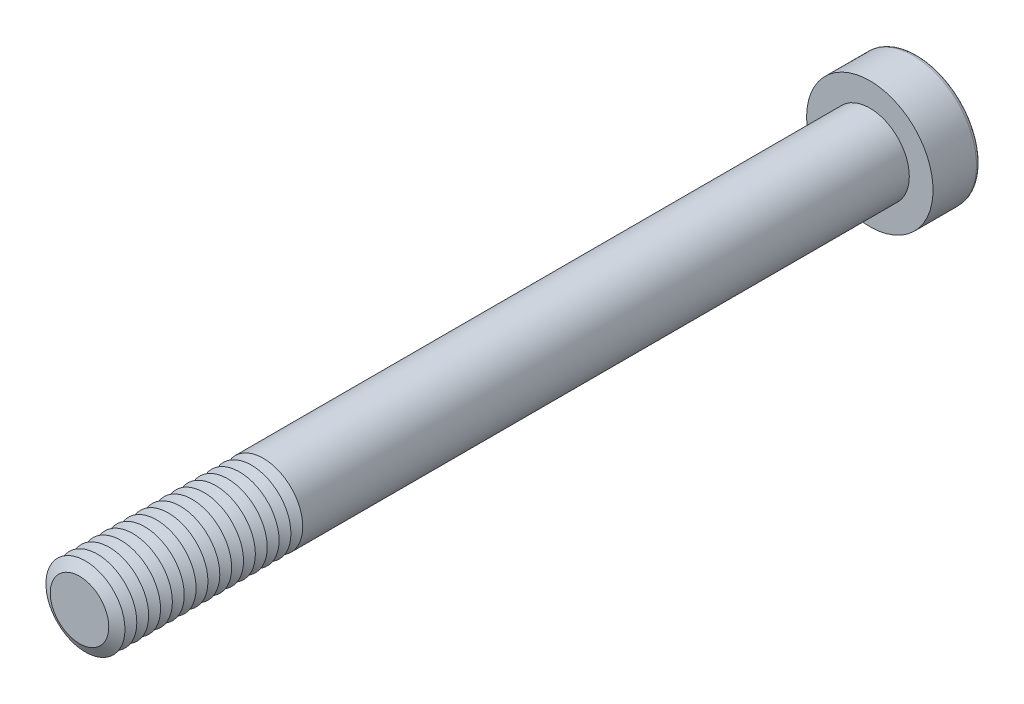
ISO-10303-21;
HEADER;
FILE_DESCRIPTION(('STEP AP214'),'2;1');
FILE_NAME('part.step','',(''),(''),'','','');
FILE_SCHEMA(('AUTOMOTIVE_DESIGN { 1 0 10303 214 1 1 1 1 }'));
ENDSEC;
DATA;
#1=APPLICATION_CONTEXT('core data for automotive mechanical design processes');
#2=APPLICATION_PROTOCOL_DEFINITION('international standard','automotive_design',2000,#1);
#3=PRODUCT_CONTEXT('',#1,'mechanical');
#4=PRODUCT('Part','Part','',(#3));
#5=PRODUCT_RELATED_PRODUCT_CATEGORY('part','',(#4));
#6=PRODUCT_DEFINITION_FORMATION('','',#4);
#7=PRODUCT_DEFINITION_CONTEXT('part definition',#1,'design');
#8=PRODUCT_DEFINITION('design','',#6,#7);
#9=PRODUCT_DEFINITION_SHAPE('','',#8);
#10=(LENGTH_UNIT() NAMED_UNIT(*) SI_UNIT(.MILLI.,.METRE.));
#11=(NAMED_UNIT(*) PLANE_ANGLE_UNIT() SI_UNIT($,.RADIAN.));
#12=(NAMED_UNIT(*) SI_UNIT($,.STERADIAN.) SOLID_ANGLE_UNIT());
#13=UNCERTAINTY_MEASURE_WITH_UNIT(LENGTH_MEASURE(1.E-05),#10,'distance_accuracy_value','');
#14=(GEOMETRIC_REPRESENTATION_CONTEXT(3) GLOBAL_UNCERTAINTY_ASSIGNED_CONTEXT((#13)) GLOBAL_UNIT_ASSIGNED_CONTEXT((#10,
#11,#12)) REPRESENTATION_CONTEXT('',''));
#15=CARTESIAN_POINT('',(0.,0.,0.));
#16=DIRECTION('',(0.,0.,1.));
#17=DIRECTION('',(1.,0.,0.));
#18=AXIS2_PLACEMENT_3D('',#15,#16,#17);
#19=CARTESIAN_POINT('',(0.,0.,94.75));
#20=DIRECTION('',(0.,0.,1.));
#21=DIRECTION('',(1.,0.,0.));
#22=AXIS2_PLACEMENT_3D('',#19,#20,#21);
#23=CONICAL_SURFACE('',#22,5.,1.0471975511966);
#24=CARTESIAN_POINT('',(0.,0.,94.));
#25=DIRECTION('',(0.,0.,1.));
#26=DIRECTION('',(1.,0.,0.));
#27=AXIS2_PLACEMENT_3D('',#24,#25,#26);
#28=CIRCLE('',#27,3.70096189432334);
#29=CARTESIAN_POINT('',(3.70096189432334,0.,94.));
#30=VERTEX_POINT('',#29);
#31=EDGE_CURVE('E313',#30,#30,#28,.T.);
#32=ORIENTED_EDGE('',*,*,#31,.T.);
#33=EDGE_LOOP('',(#32));
#34=FACE_BOUND('',#33,.T.);
#35=CARTESIAN_POINT('',(0.,0.,94.75));
#36=DIRECTION('',(0.,0.,1.));
#37=DIRECTION('',(1.,0.,0.));
#38=AXIS2_PLACEMENT_3D('',#35,#36,#37);
#39=CIRCLE('',#38,5.);
#40=CARTESIAN_POINT('',(5.,0.,94.75));
#41=VERTEX_POINT('',#40);
#42=EDGE_CURVE('E316',#41,#41,#39,.T.);
#43=ORIENTED_EDGE('',*,*,#42,.F.);
#44=EDGE_LOOP('',(#43));
#45=FACE_BOUND('',#44,.T.);
#46=ADVANCED_FACE('F39',(#34,#45),#23,.T.);
#47=CARTESIAN_POINT('',(0.,0.,94.));
#48=DIRECTION('',(0.,0.,-1.));
#49=DIRECTION('',(-1.,0.,0.));
#50=AXIS2_PLACEMENT_3D('',#47,#48,#49);
#51=CONICAL_SURFACE('',#50,3.70096189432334,1.0471975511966);
#52=CARTESIAN_POINT('',(0.,0.,93.25));
#53=DIRECTION('',(0.,0.,1.));
#54=DIRECTION('',(1.,0.,0.));
#55=AXIS2_PLACEMENT_3D('',#52,#53,#54);
#56=CIRCLE('',#55,5.);
#57=CARTESIAN_POINT('',(5.,0.,93.25));
#58=VERTEX_POINT('',#57);
#59=EDGE_CURVE('E324',#58,#58,#56,.T.);
#60=ORIENTED_EDGE('',*,*,#59,.T.);
#61=EDGE_LOOP('',(#60));
#62=FACE_BOUND('',#61,.T.);
#63=ORIENTED_EDGE('',*,*,#31,.F.);
#64=EDGE_LOOP('',(#63));
#65=FACE_BOUND('',#64,.T.);
#66=ADVANCED_FACE('F244',(#62,#65),#51,.T.);
#67=CARTESIAN_POINT('',(0.,0.,100.));
#68=DIRECTION('',(0.,0.,1.));
#69=DIRECTION('',(1.,0.,0.));
#70=AXIS2_PLACEMENT_3D('',#67,#68,#69);
#71=PLANE('',#70);
#72=CARTESIAN_POINT('',(0.,0.,100.));
#73=DIRECTION('',(0.,0.,1.));
#74=DIRECTION('',(1.,0.,0.));
#75=AXIS2_PLACEMENT_3D('',#72,#73,#74);
#76=CIRCLE('',#75,3.70096189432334);
#77=CARTESIAN_POINT('',(3.70096189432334,0.,100.));
#78=VERTEX_POINT('',#77);
#79=EDGE_CURVE('E173',#78,#78,#76,.T.);
#80=ORIENTED_EDGE('',*,*,#79,.T.);
#81=EDGE_LOOP('',(#80));
#82=FACE_BOUND('',#81,.T.);
#83=ADVANCED_FACE('F250',(#82),#71,.T.);
#84=CARTESIAN_POINT('',(0.,0.,100.));
#85=DIRECTION('',(0.,0.,-1.));
#86=DIRECTION('',(-1.,0.,0.));
#87=AXIS2_PLACEMENT_3D('',#84,#85,#86);
#88=CONICAL_SURFACE('',#87,3.70096189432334,1.0471975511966);
#89=CARTESIAN_POINT('',(0.,0.,99.25));
#90=DIRECTION('',(0.,0.,1.));
#91=DIRECTION('',(1.,0.,0.));
#92=AXIS2_PLACEMENT_3D('',#89,#90,#91);
#93=CIRCLE('',#92,5.);
#94=CARTESIAN_POINT('',(5.,0.,99.25));
#95=VERTEX_POINT('',#94);
#96=EDGE_CURVE('E290',#95,#95,#93,.T.);
#97=ORIENTED_EDGE('',*,*,#96,.T.);
#98=EDGE_LOOP('',(#97));
#99=FACE_BOUND('',#98,.T.);
#100=ORIENTED_EDGE('',*,*,#79,.F.);
#101=EDGE_LOOP('',(#100));
#102=FACE_BOUND('',#101,.T.);
#103=ADVANCED_FACE('F198',(#99,#102),#88,.T.);
#104=CARTESIAN_POINT('',(0.,0.,99.25));
#105=DIRECTION('',(0.,0.,1.));
#106=DIRECTION('',(1.,0.,0.));
#107=AXIS2_PLACEMENT_3D('',#104,#105,#106);
#108=CONICAL_SURFACE('',#107,5.,1.0471975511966);
#109=CARTESIAN_POINT('',(0.,0.,98.5));
#110=DIRECTION('',(0.,0.,1.));
#111=DIRECTION('',(1.,0.,0.));
#112=AXIS2_PLACEMENT_3D('',#109,#110,#111);
#113=CIRCLE('',#112,3.70096189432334);
#114=CARTESIAN_POINT('',(3.70096189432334,0.,98.5));
#115=VERTEX_POINT('',#114);
#116=EDGE_CURVE('E287',#115,#115,#113,.T.);
#117=ORIENTED_EDGE('',*,*,#116,.T.);
#118=EDGE_LOOP('',(#117));
#119=FACE_BOUND('',#118,.T.);
#120=ORIENTED_EDGE('',*,*,#96,.F.);
#121=EDGE_LOOP('',(#120));
#122=FACE_BOUND('',#121,.T.);
#123=ADVANCED_FACE('F276',(#119,#122),#108,.T.);
#124=CARTESIAN_POINT('',(0.,0.,98.5));
#125=DIRECTION('',(0.,0.,-1.));
#126=DIRECTION('',(-1.,0.,0.));
#127=AXIS2_PLACEMENT_3D('',#124,#125,#126);
#128=CONICAL_SURFACE('',#127,3.70096189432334,1.0471975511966);
#129=CARTESIAN_POINT('',(0.,0.,97.75));
#130=DIRECTION('',(0.,0.,1.));
#131=DIRECTION('',(1.,0.,0.));
#132=AXIS2_PLACEMENT_3D('',#129,#130,#131);
#133=CIRCLE('',#132,5.);
#134=CARTESIAN_POINT('',(5.,0.,97.75));
#135=VERTEX_POINT('',#134);
#136=EDGE_CURVE('E299',#135,#135,#133,.T.);
#137=ORIENTED_EDGE('',*,*,#136,.T.);
#138=EDGE_LOOP('',(#137));
#139=FACE_BOUND('',#138,.T.);
#140=ORIENTED_EDGE('',*,*,#116,.F.);
#141=EDGE_LOOP('',(#140));
#142=FACE_BOUND('',#141,.T.);
#143=ADVANCED_FACE('F273',(#139,#142),#128,.T.);
#144=CARTESIAN_POINT('',(0.,0.,97.75));
#145=DIRECTION('',(0.,0.,1.));
#146=DIRECTION('',(1.,0.,0.));
#147=AXIS2_PLACEMENT_3D('',#144,#145,#146);
#148=CONICAL_SURFACE('',#147,5.,1.0471975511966);
#149=CARTESIAN_POINT('',(0.,0.,97.));
#150=DIRECTION('',(0.,0.,1.));
#151=DIRECTION('',(1.,0.,0.));
#152=AXIS2_PLACEMENT_3D('',#149,#150,#151);
#153=CIRCLE('',#152,3.70096189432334);
#154=CARTESIAN_POINT('',(3.70096189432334,0.,97.));
#155=VERTEX_POINT('',#154);
#156=EDGE_CURVE('E292',#155,#155,#153,.T.);
#157=ORIENTED_EDGE('',*,*,#156,.T.);
#158=EDGE_LOOP('',(#157));
#159=FACE_BOUND('',#158,.T.);
#160=ORIENTED_EDGE('',*,*,#136,.F.);
#161=EDGE_LOOP('',(#160));
#162=FACE_BOUND('',#161,.T.);
#163=ADVANCED_FACE('F269',(#159,#162),#148,.T.);
#164=CARTESIAN_POINT('',(0.,0.,97.));
#165=DIRECTION('',(0.,0.,-1.));
#166=DIRECTION('',(-1.,0.,0.));
#167=AXIS2_PLACEMENT_3D('',#164,#165,#166);
#168=CONICAL_SURFACE('',#167,3.70096189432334,1.0471975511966);
#169=CARTESIAN_POINT('',(0.,0.,96.25));
#170=DIRECTION('',(0.,0.,1.));
#171=DIRECTION('',(1.,0.,0.));
#172=AXIS2_PLACEMENT_3D('',#169,#170,#171);
#173=CIRCLE('',#172,5.);
#174=CARTESIAN_POINT('',(5.,0.,96.25));
#175=VERTEX_POINT('',#174);
#176=EDGE_CURVE('E309',#175,#175,#173,.T.);
#177=ORIENTED_EDGE('',*,*,#176,.T.);
#178=EDGE_LOOP('',(#177));
#179=FACE_BOUND('',#178,.T.);
#180=ORIENTED_EDGE('',*,*,#156,.F.);
#181=EDGE_LOOP('',(#180));
#182=FACE_BOUND('',#181,.T.);
#183=ADVANCED_FACE('F265',(#179,#182),#168,.T.);
#184=CARTESIAN_POINT('',(0.,0.,96.25));
#185=DIRECTION('',(0.,0.,1.));
#186=DIRECTION('',(1.,0.,0.));
#187=AXIS2_PLACEMENT_3D('',#184,#185,#186);
#188=CONICAL_SURFACE('',#187,5.,1.0471975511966);
#189=CARTESIAN_POINT('',(0.,0.,95.5));
#190=DIRECTION('',(0.,0.,1.));
#191=DIRECTION('',(1.,0.,0.));
#192=AXIS2_PLACEMENT_3D('',#189,#190,#191);
#193=CIRCLE('',#192,3.70096189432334);
#194=CARTESIAN_POINT('',(3.70096189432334,0.,95.5));
#195=VERTEX_POINT('',#194);
#196=EDGE_CURVE('E305',#195,#195,#193,.T.);
#197=ORIENTED_EDGE('',*,*,#196,.T.);
#198=EDGE_LOOP('',(#197));
#199=FACE_BOUND('',#198,.T.);
#200=ORIENTED_EDGE('',*,*,#176,.F.);
#201=EDGE_LOOP('',(#200));
#202=FACE_BOUND('',#201,.T.);
#203=ADVANCED_FACE('F261',(#199,#202),#188,.T.);
#204=CARTESIAN_POINT('',(0.,0.,95.5));
#205=DIRECTION('',(0.,0.,-1.));
#206=DIRECTION('',(-1.,0.,0.));
#207=AXIS2_PLACEMENT_3D('',#204,#205,#206);
#208=CONICAL_SURFACE('',#207,3.70096189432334,1.0471975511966);
#209=ORIENTED_EDGE('',*,*,#42,.T.);
#210=EDGE_LOOP('',(#209));
#211=FACE_BOUND('',#210,.T.);
#212=ORIENTED_EDGE('',*,*,#196,.F.);
#213=EDGE_LOOP('',(#212));
#214=FACE_BOUND('',#213,.T.);
#215=ADVANCED_FACE('F257',(#211,#214),#208,.T.);
#216=CARTESIAN_POINT('',(0.,0.,93.25));
#217=DIRECTION('',(0.,0.,1.));
#218=DIRECTION('',(1.,0.,0.));
#219=AXIS2_PLACEMENT_3D('',#216,#217,#218);
#220=CONICAL_SURFACE('',#219,5.,1.0471975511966);
#221=CARTESIAN_POINT('',(0.,0.,92.5));
#222=DIRECTION('',(0.,0.,1.));
#223=DIRECTION('',(1.,0.,0.));
#224=AXIS2_PLACEMENT_3D('',#221,#222,#223);
#225=CIRCLE('',#224,3.70096189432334);
#226=CARTESIAN_POINT('',(3.70096189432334,0.,92.5));
#227=VERTEX_POINT('',#226);
#228=EDGE_CURVE('E320',#227,#227,#225,.T.);
#229=ORIENTED_EDGE('',*,*,#228,.T.);
#230=EDGE_LOOP('',(#229));
#231=FACE_BOUND('',#230,.T.);
#232=ORIENTED_EDGE('',*,*,#59,.F.);
#233=EDGE_LOOP('',(#232));
#234=FACE_BOUND('',#233,.T.);
#235=ADVANCED_FACE('F260',(#231,#234),#220,.T.);
#236=CARTESIAN_POINT('',(0.,0.,92.5));
#237=DIRECTION('',(0.,0.,-1.));
#238=DIRECTION('',(-1.,0.,0.));
#239=AXIS2_PLACEMENT_3D('',#236,#237,#238);
#240=CONICAL_SURFACE('',#239,3.70096189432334,1.0471975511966);
#241=CARTESIAN_POINT('',(0.,0.,91.75));
#242=DIRECTION('',(0.,0.,1.));
#243=DIRECTION('',(1.,0.,0.));
#244=AXIS2_PLACEMENT_3D('',#241,#242,#243);
#245=CIRCLE('',#244,5.);
#246=CARTESIAN_POINT('',(5.,0.,91.75));
#247=VERTEX_POINT('',#246);
#248=EDGE_CURVE('E332',#247,#247,#245,.T.);
#249=ORIENTED_EDGE('',*,*,#248,.T.);
#250=EDGE_LOOP('',(#249));
#251=FACE_BOUND('',#250,.T.);
#252=ORIENTED_EDGE('',*,*,#228,.F.);
#253=EDGE_LOOP('',(#252));
#254=FACE_BOUND('',#253,.T.);
#255=ADVANCED_FACE('F496',(#251,#254),#240,.T.);
#256=CARTESIAN_POINT('',(0.,0.,91.75));
#257=DIRECTION('',(0.,0.,1.));
#258=DIRECTION('',(1.,0.,0.));
#259=AXIS2_PLACEMENT_3D('',#256,#257,#258);
#260=CONICAL_SURFACE('',#259,5.,1.0471975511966);
#261=CARTESIAN_POINT('',(0.,0.,91.));
#262=DIRECTION('',(0.,0.,1.));
#263=DIRECTION('',(1.,0.,0.));
#264=AXIS2_PLACEMENT_3D('',#261,#262,#263);
#265=CIRCLE('',#264,3.70096189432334);
#266=CARTESIAN_POINT('',(3.70096189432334,0.,91.));
#267=VERTEX_POINT('',#266);
#268=EDGE_CURVE('E328',#267,#267,#265,.T.);
#269=ORIENTED_EDGE('',*,*,#268,.T.);
#270=EDGE_LOOP('',(#269));
#271=FACE_BOUND('',#270,.T.);
#272=ORIENTED_EDGE('',*,*,#248,.F.);
#273=EDGE_LOOP('',(#272));
#274=FACE_BOUND('',#273,.T.);
#275=ADVANCED_FACE('F492',(#271,#274),#260,.T.);
#276=CARTESIAN_POINT('',(0.,0.,91.));
#277=DIRECTION('',(0.,0.,-1.));
#278=DIRECTION('',(-1.,0.,0.));
#279=AXIS2_PLACEMENT_3D('',#276,#277,#278);
#280=CONICAL_SURFACE('',#279,3.70096189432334,1.0471975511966);
#281=CARTESIAN_POINT('',(0.,0.,90.25));
#282=DIRECTION('',(0.,0.,1.));
#283=DIRECTION('',(1.,0.,0.));
#284=AXIS2_PLACEMENT_3D('',#281,#282,#283);
#285=CIRCLE('',#284,5.);
#286=CARTESIAN_POINT('',(5.,0.,90.25));
#287=VERTEX_POINT('',#286);
#288=EDGE_CURVE('E340',#287,#287,#285,.T.);
#289=ORIENTED_EDGE('',*,*,#288,.T.);
#290=EDGE_LOOP('',(#289));
#291=FACE_BOUND('',#290,.T.);
#292=ORIENTED_EDGE('',*,*,#268,.F.);
#293=EDGE_LOOP('',(#292));
#294=FACE_BOUND('',#293,.T.);
#295=ADVANCED_FACE('F488',(#291,#294),#280,.T.);
#296=CARTESIAN_POINT('',(0.,0.,90.25));
#297=DIRECTION('',(0.,0.,1.));
#298=DIRECTION('',(1.,0.,0.));
#299=AXIS2_PLACEMENT_3D('',#296,#297,#298);
#300=CONICAL_SURFACE('',#299,5.,1.0471975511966);
#301=CARTESIAN_POINT('',(0.,0.,89.5));
#302=DIRECTION('',(0.,0.,1.));
#303=DIRECTION('',(1.,0.,0.));
#304=AXIS2_PLACEMENT_3D('',#301,#302,#303);
#305=CIRCLE('',#304,3.70096189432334);
#306=CARTESIAN_POINT('',(3.70096189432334,0.,89.5));
#307=VERTEX_POINT('',#306);
#308=EDGE_CURVE('E336',#307,#307,#305,.T.);
#309=ORIENTED_EDGE('',*,*,#308,.T.);
#310=EDGE_LOOP('',(#309));
#311=FACE_BOUND('',#310,.T.);
#312=ORIENTED_EDGE('',*,*,#288,.F.);
#313=EDGE_LOOP('',(#312));
#314=FACE_BOUND('',#313,.T.);
#315=ADVANCED_FACE('F484',(#311,#314),#300,.T.);
#316=CARTESIAN_POINT('',(0.,0.,89.5));
#317=DIRECTION('',(0.,0.,-1.));
#318=DIRECTION('',(-1.,0.,0.));
#319=AXIS2_PLACEMENT_3D('',#316,#317,#318);
#320=CONICAL_SURFACE('',#319,3.70096189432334,1.0471975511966);
#321=CARTESIAN_POINT('',(0.,0.,88.75));
#322=DIRECTION('',(0.,0.,1.));
#323=DIRECTION('',(1.,0.,0.));
#324=AXIS2_PLACEMENT_3D('',#321,#322,#323);
#325=CIRCLE('',#324,5.);
#326=CARTESIAN_POINT('',(5.,0.,88.75));
#327=VERTEX_POINT('',#326);
#328=EDGE_CURVE('E348',#327,#327,#325,.T.);
#329=ORIENTED_EDGE('',*,*,#328,.T.);
#330=EDGE_LOOP('',(#329));
#331=FACE_BOUND('',#330,.T.);
#332=ORIENTED_EDGE('',*,*,#308,.F.);
#333=EDGE_LOOP('',(#332));
#334=FACE_BOUND('',#333,.T.);
#335=ADVANCED_FACE('F480',(#331,#334),#320,.T.);
#336=CARTESIAN_POINT('',(0.,0.,88.75));
#337=DIRECTION('',(0.,0.,1.));
#338=DIRECTION('',(1.,0.,0.));
#339=AXIS2_PLACEMENT_3D('',#336,#337,#338);
#340=CONICAL_SURFACE('',#339,5.,1.0471975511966);
#341=CARTESIAN_POINT('',(0.,0.,88.));
#342=DIRECTION('',(0.,0.,1.));
#343=DIRECTION('',(1.,0.,0.));
#344=AXIS2_PLACEMENT_3D('',#341,#342,#343);
#345=CIRCLE('',#344,3.70096189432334);
#346=CARTESIAN_POINT('',(3.70096189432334,0.,88.));
#347=VERTEX_POINT('',#346);
#348=EDGE_CURVE('E344',#347,#347,#345,.T.);
#349=ORIENTED_EDGE('',*,*,#348,.T.);
#350=EDGE_LOOP('',(#349));
#351=FACE_BOUND('',#350,.T.);
#352=ORIENTED_EDGE('',*,*,#328,.F.);
#353=EDGE_LOOP('',(#352));
#354=FACE_BOUND('',#353,.T.);
#355=ADVANCED_FACE('F476',(#351,#354),#340,.T.);
#356=CARTESIAN_POINT('',(0.,0.,88.));
#357=DIRECTION('',(0.,0.,-1.));
#358=DIRECTION('',(-1.,0.,0.));
#359=AXIS2_PLACEMENT_3D('',#356,#357,#358);
#360=CONICAL_SURFACE('',#359,3.70096189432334,1.0471975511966);
#361=CARTESIAN_POINT('',(0.,0.,87.25));
#362=DIRECTION('',(0.,0.,1.));
#363=DIRECTION('',(1.,0.,0.));
#364=AXIS2_PLACEMENT_3D('',#361,#362,#363);
#365=CIRCLE('',#364,5.);
#366=CARTESIAN_POINT('',(5.,0.,87.25));
#367=VERTEX_POINT('',#366);
#368=EDGE_CURVE('E356',#367,#367,#365,.T.);
#369=ORIENTED_EDGE('',*,*,#368,.T.);
#370=EDGE_LOOP('',(#369));
#371=FACE_BOUND('',#370,.T.);
#372=ORIENTED_EDGE('',*,*,#348,.F.);
#373=EDGE_LOOP('',(#372));
#374=FACE_BOUND('',#373,.T.);
#375=ADVANCED_FACE('F472',(#371,#374),#360,.T.);
#376=CARTESIAN_POINT('',(0.,0.,87.25));
#377=DIRECTION('',(0.,0.,1.));
#378=DIRECTION('',(1.,0.,0.));
#379=AXIS2_PLACEMENT_3D('',#376,#377,#378);
#380=CONICAL_SURFACE('',#379,5.,1.0471975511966);
#381=CARTESIAN_POINT('',(0.,0.,86.5));
#382=DIRECTION('',(0.,0.,1.));
#383=DIRECTION('',(1.,0.,0.));
#384=AXIS2_PLACEMENT_3D('',#381,#382,#383);
#385=CIRCLE('',#384,3.70096189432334);
#386=CARTESIAN_POINT('',(3.70096189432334,0.,86.5));
#387=VERTEX_POINT('',#386);
#388=EDGE_CURVE('E352',#387,#387,#385,.T.);
#389=ORIENTED_EDGE('',*,*,#388,.T.);
#390=EDGE_LOOP('',(#389));
#391=FACE_BOUND('',#390,.T.);
#392=ORIENTED_EDGE('',*,*,#368,.F.);
#393=EDGE_LOOP('',(#392));
#394=FACE_BOUND('',#393,.T.);
#395=ADVANCED_FACE('F468',(#391,#394),#380,.T.);
#396=CARTESIAN_POINT('',(0.,0.,86.5));
#397=DIRECTION('',(0.,0.,-1.));
#398=DIRECTION('',(-1.,0.,0.));
#399=AXIS2_PLACEMENT_3D('',#396,#397,#398);
#400=CONICAL_SURFACE('',#399,3.70096189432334,1.0471975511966);
#401=CARTESIAN_POINT('',(0.,0.,85.75));
#402=DIRECTION('',(0.,0.,1.));
#403=DIRECTION('',(1.,0.,0.));
#404=AXIS2_PLACEMENT_3D('',#401,#402,#403);
#405=CIRCLE('',#404,5.);
#406=CARTESIAN_POINT('',(5.,0.,85.75));
#407=VERTEX_POINT('',#406);
#408=EDGE_CURVE('E364',#407,#407,#405,.T.);
#409=ORIENTED_EDGE('',*,*,#408,.T.);
#410=EDGE_LOOP('',(#409));
#411=FACE_BOUND('',#410,.T.);
#412=ORIENTED_EDGE('',*,*,#388,.F.);
#413=EDGE_LOOP('',(#412));
#414=FACE_BOUND('',#413,.T.);
#415=ADVANCED_FACE('F464',(#411,#414),#400,.T.);
#416=CARTESIAN_POINT('',(0.,0.,85.75));
#417=DIRECTION('',(0.,0.,1.));
#418=DIRECTION('',(1.,0.,0.));
#419=AXIS2_PLACEMENT_3D('',#416,#417,#418);
#420=CONICAL_SURFACE('',#419,5.,1.0471975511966);
#421=CARTESIAN_POINT('',(0.,0.,85.));
#422=DIRECTION('',(0.,0.,1.));
#423=DIRECTION('',(1.,0.,0.));
#424=AXIS2_PLACEMENT_3D('',#421,#422,#423);
#425=CIRCLE('',#424,3.70096189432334);
#426=CARTESIAN_POINT('',(3.70096189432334,0.,85.));
#427=VERTEX_POINT('',#426);
#428=EDGE_CURVE('E360',#427,#427,#425,.T.);
#429=ORIENTED_EDGE('',*,*,#428,.T.);
#430=EDGE_LOOP('',(#429));
#431=FACE_BOUND('',#430,.T.);
#432=ORIENTED_EDGE('',*,*,#408,.F.);
#433=EDGE_LOOP('',(#432));
#434=FACE_BOUND('',#433,.T.);
#435=ADVANCED_FACE('F460',(#431,#434),#420,.T.);
#436=CARTESIAN_POINT('',(0.,0.,85.));
#437=DIRECTION('',(0.,0.,-1.));
#438=DIRECTION('',(-1.,0.,0.));
#439=AXIS2_PLACEMENT_3D('',#436,#437,#438);
#440=CONICAL_SURFACE('',#439,3.70096189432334,1.0471975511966);
#441=CARTESIAN_POINT('',(0.,0.,84.25));
#442=DIRECTION('',(0.,0.,1.));
#443=DIRECTION('',(1.,0.,0.));
#444=AXIS2_PLACEMENT_3D('',#441,#442,#443);
#445=CIRCLE('',#444,5.);
#446=CARTESIAN_POINT('',(5.,0.,84.25));
#447=VERTEX_POINT('',#446);
#448=EDGE_CURVE('E372',#447,#447,#445,.T.);
#449=ORIENTED_EDGE('',*,*,#448,.T.);
#450=EDGE_LOOP('',(#449));
#451=FACE_BOUND('',#450,.T.);
#452=ORIENTED_EDGE('',*,*,#428,.F.);
#453=EDGE_LOOP('',(#452));
#454=FACE_BOUND('',#453,.T.);
#455=ADVANCED_FACE('F456',(#451,#454),#440,.T.);
#456=CARTESIAN_POINT('',(0.,0.,84.25));
#457=DIRECTION('',(0.,0.,1.));
#458=DIRECTION('',(1.,0.,0.));
#459=AXIS2_PLACEMENT_3D('',#456,#457,#458);
#460=CONICAL_SURFACE('',#459,5.,1.0471975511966);
#461=CARTESIAN_POINT('',(0.,0.,83.5));
#462=DIRECTION('',(0.,0.,1.));
#463=DIRECTION('',(1.,0.,0.));
#464=AXIS2_PLACEMENT_3D('',#461,#462,#463);
#465=CIRCLE('',#464,3.70096189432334);
#466=CARTESIAN_POINT('',(3.70096189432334,0.,83.5));
#467=VERTEX_POINT('',#466);
#468=EDGE_CURVE('E368',#467,#467,#465,.T.);
#469=ORIENTED_EDGE('',*,*,#468,.T.);
#470=EDGE_LOOP('',(#469));
#471=FACE_BOUND('',#470,.T.);
#472=ORIENTED_EDGE('',*,*,#448,.F.);
#473=EDGE_LOOP('',(#472));
#474=FACE_BOUND('',#473,.T.);
#475=ADVANCED_FACE('F452',(#471,#474),#460,.T.);
#476=CARTESIAN_POINT('',(0.,0.,83.5));
#477=DIRECTION('',(0.,0.,-1.));
#478=DIRECTION('',(-1.,0.,0.));
#479=AXIS2_PLACEMENT_3D('',#476,#477,#478);
#480=CONICAL_SURFACE('',#479,3.70096189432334,1.0471975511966);
#481=CARTESIAN_POINT('',(0.,0.,82.75));
#482=DIRECTION('',(0.,0.,1.));
#483=DIRECTION('',(1.,0.,0.));
#484=AXIS2_PLACEMENT_3D('',#481,#482,#483);
#485=CIRCLE('',#484,5.);
#486=CARTESIAN_POINT('',(5.,0.,82.75));
#487=VERTEX_POINT('',#486);
#488=EDGE_CURVE('E380',#487,#487,#485,.T.);
#489=ORIENTED_EDGE('',*,*,#488,.T.);
#490=EDGE_LOOP('',(#489));
#491=FACE_BOUND('',#490,.T.);
#492=ORIENTED_EDGE('',*,*,#468,.F.);
#493=EDGE_LOOP('',(#492));
#494=FACE_BOUND('',#493,.T.);
#495=ADVANCED_FACE('F448',(#491,#494),#480,.T.);
#496=CARTESIAN_POINT('',(0.,0.,82.75));
#497=DIRECTION('',(0.,0.,1.));
#498=DIRECTION('',(1.,0.,0.));
#499=AXIS2_PLACEMENT_3D('',#496,#497,#498);
#500=CONICAL_SURFACE('',#499,5.,1.0471975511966);
#501=CARTESIAN_POINT('',(0.,0.,82.));
#502=DIRECTION('',(0.,0.,1.));
#503=DIRECTION('',(1.,0.,0.));
#504=AXIS2_PLACEMENT_3D('',#501,#502,#503);
#505=CIRCLE('',#504,3.70096189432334);
#506=CARTESIAN_POINT('',(3.70096189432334,0.,82.));
#507=VERTEX_POINT('',#506);
#508=EDGE_CURVE('E376',#507,#507,#505,.T.);
#509=ORIENTED_EDGE('',*,*,#508,.T.);
#510=EDGE_LOOP('',(#509));
#511=FACE_BOUND('',#510,.T.);
#512=ORIENTED_EDGE('',*,*,#488,.F.);
#513=EDGE_LOOP('',(#512));
#514=FACE_BOUND('',#513,.T.);
#515=ADVANCED_FACE('F444',(#511,#514),#500,.T.);
#516=CARTESIAN_POINT('',(0.,0.,82.));
#517=DIRECTION('',(0.,0.,-1.));
#518=DIRECTION('',(-1.,0.,0.));
#519=AXIS2_PLACEMENT_3D('',#516,#517,#518);
#520=CONICAL_SURFACE('',#519,3.70096189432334,1.0471975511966);
#521=CARTESIAN_POINT('',(0.,0.,81.25));
#522=DIRECTION('',(0.,0.,1.));
#523=DIRECTION('',(1.,0.,0.));
#524=AXIS2_PLACEMENT_3D('',#521,#522,#523);
#525=CIRCLE('',#524,5.);
#526=CARTESIAN_POINT('',(5.,0.,81.25));
#527=VERTEX_POINT('',#526);
#528=EDGE_CURVE('E387',#527,#527,#525,.T.);
#529=ORIENTED_EDGE('',*,*,#528,.T.);
#530=EDGE_LOOP('',(#529));
#531=FACE_BOUND('',#530,.T.);
#532=ORIENTED_EDGE('',*,*,#508,.F.);
#533=EDGE_LOOP('',(#532));
#534=FACE_BOUND('',#533,.T.);
#535=ADVANCED_FACE('F440',(#531,#534),#520,.T.);
#536=CARTESIAN_POINT('',(0.,0.,81.25));
#537=DIRECTION('',(0.,0.,1.));
#538=DIRECTION('',(1.,0.,0.));
#539=AXIS2_PLACEMENT_3D('',#536,#537,#538);
#540=CONICAL_SURFACE('',#539,5.,1.0471975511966);
#541=CARTESIAN_POINT('',(0.,0.,80.5));
#542=DIRECTION('',(0.,0.,1.));
#543=DIRECTION('',(1.,0.,0.));
#544=AXIS2_PLACEMENT_3D('',#541,#542,#543);
#545=CIRCLE('',#544,3.70096189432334);
#546=CARTESIAN_POINT('',(3.70096189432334,0.,80.5));
#547=VERTEX_POINT('',#546);
#548=EDGE_CURVE('E383',#547,#547,#545,.T.);
#549=ORIENTED_EDGE('',*,*,#548,.T.);
#550=EDGE_LOOP('',(#549));
#551=FACE_BOUND('',#550,.T.);
#552=ORIENTED_EDGE('',*,*,#528,.F.);
#553=EDGE_LOOP('',(#552));
#554=FACE_BOUND('',#553,.T.);
#555=ADVANCED_FACE('F436',(#551,#554),#540,.T.);
#556=CARTESIAN_POINT('',(0.,0.,80.5));
#557=DIRECTION('',(0.,0.,-1.));
#558=DIRECTION('',(-1.,0.,0.));
#559=AXIS2_PLACEMENT_3D('',#556,#557,#558);
#560=CONICAL_SURFACE('',#559,3.70096189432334,1.0471975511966);
#561=CARTESIAN_POINT('',(0.,0.,79.75));
#562=DIRECTION('',(0.,0.,1.));
#563=DIRECTION('',(1.,0.,0.));
#564=AXIS2_PLACEMENT_3D('',#561,#562,#563);
#565=CIRCLE('',#564,5.);
#566=CARTESIAN_POINT('',(5.,0.,79.75));
#567=VERTEX_POINT('',#566);
#568=EDGE_CURVE('E395',#567,#567,#565,.T.);
#569=ORIENTED_EDGE('',*,*,#568,.T.);
#570=EDGE_LOOP('',(#569));
#571=FACE_BOUND('',#570,.T.);
#572=ORIENTED_EDGE('',*,*,#548,.F.);
#573=EDGE_LOOP('',(#572));
#574=FACE_BOUND('',#573,.T.);
#575=ADVANCED_FACE('F432',(#571,#574),#560,.T.);
#576=CARTESIAN_POINT('',(0.,0.,79.75));
#577=DIRECTION('',(0.,0.,1.));
#578=DIRECTION('',(1.,0.,0.));
#579=AXIS2_PLACEMENT_3D('',#576,#577,#578);
#580=CONICAL_SURFACE('',#579,5.,1.0471975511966);
#581=CARTESIAN_POINT('',(0.,0.,79.));
#582=DIRECTION('',(0.,0.,1.));
#583=DIRECTION('',(1.,0.,0.));
#584=AXIS2_PLACEMENT_3D('',#581,#582,#583);
#585=CIRCLE('',#584,3.70096189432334);
#586=CARTESIAN_POINT('',(3.70096189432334,0.,79.));
#587=VERTEX_POINT('',#586);
#588=EDGE_CURVE('E391',#587,#587,#585,.T.);
#589=ORIENTED_EDGE('',*,*,#588,.T.);
#590=EDGE_LOOP('',(#589));
#591=FACE_BOUND('',#590,.T.);
#592=ORIENTED_EDGE('',*,*,#568,.F.);
#593=EDGE_LOOP('',(#592));
#594=FACE_BOUND('',#593,.T.);
#595=ADVANCED_FACE('F427',(#591,#594),#580,.T.);
#596=CARTESIAN_POINT('',(0.,0.,79.));
#597=DIRECTION('',(0.,0.,-1.));
#598=DIRECTION('',(-1.,0.,0.));
#599=AXIS2_PLACEMENT_3D('',#596,#597,#598);
#600=CONICAL_SURFACE('',#599,3.70096189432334,1.0471975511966);
#601=CARTESIAN_POINT('',(0.,0.,78.25));
#602=DIRECTION('',(0.,0.,1.));
#603=DIRECTION('',(1.,0.,0.));
#604=AXIS2_PLACEMENT_3D('',#601,#602,#603);
#605=CIRCLE('',#604,5.);
#606=CARTESIAN_POINT('',(5.,0.,78.25));
#607=VERTEX_POINT('',#606);
#608=EDGE_CURVE('E407',#607,#607,#605,.T.);
#609=ORIENTED_EDGE('',*,*,#608,.T.);
#610=EDGE_LOOP('',(#609));
#611=FACE_BOUND('',#610,.T.);
#612=ORIENTED_EDGE('',*,*,#588,.F.);
#613=EDGE_LOOP('',(#612));
#614=FACE_BOUND('',#613,.T.);
#615=ADVANCED_FACE('F413',(#611,#614),#600,.T.);
#616=CARTESIAN_POINT('',(0.,0.,78.25));
#617=DIRECTION('',(0.,0.,1.));
#618=DIRECTION('',(1.,0.,0.));
#619=AXIS2_PLACEMENT_3D('',#616,#617,#618);
#620=CONICAL_SURFACE('',#619,5.,1.0471975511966);
#621=CARTESIAN_POINT('',(0.,0.,77.5));
#622=DIRECTION('',(0.,0.,1.));
#623=DIRECTION('',(1.,0.,0.));
#624=AXIS2_PLACEMENT_3D('',#621,#622,#623);
#625=CIRCLE('',#624,3.70096189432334);
#626=CARTESIAN_POINT('',(3.70096189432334,0.,77.5));
#627=VERTEX_POINT('',#626);
#628=EDGE_CURVE('E399',#627,#627,#625,.T.);
#629=ORIENTED_EDGE('',*,*,#628,.T.);
#630=EDGE_LOOP('',(#629));
#631=FACE_BOUND('',#630,.T.);
#632=ORIENTED_EDGE('',*,*,#608,.F.);
#633=EDGE_LOOP('',(#632));
#634=FACE_BOUND('',#633,.T.);
#635=ADVANCED_FACE('F416',(#631,#634),#620,.T.);
#636=CARTESIAN_POINT('',(0.,0.,77.5));
#637=DIRECTION('',(0.,0.,-1.));
#638=DIRECTION('',(-1.,0.,0.));
#639=AXIS2_PLACEMENT_3D('',#636,#637,#638);
#640=CONICAL_SURFACE('',#639,3.70096189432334,1.0471975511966);
#641=CARTESIAN_POINT('',(0.,0.,76.75));
#642=DIRECTION('',(0.,0.,1.));
#643=DIRECTION('',(1.,0.,0.));
#644=AXIS2_PLACEMENT_3D('',#641,#642,#643);
#645=CIRCLE('',#644,5.);
#646=CARTESIAN_POINT('',(5.,0.,76.75));
#647=VERTEX_POINT('',#646);
#648=EDGE_CURVE('E403',#647,#647,#645,.T.);
#649=ORIENTED_EDGE('',*,*,#648,.T.);
#650=EDGE_LOOP('',(#649));
#651=FACE_BOUND('',#650,.T.);
#652=ORIENTED_EDGE('',*,*,#628,.F.);
#653=EDGE_LOOP('',(#652));
#654=FACE_BOUND('',#653,.T.);
#655=ADVANCED_FACE('F418',(#651,#654),#640,.T.);
#656=CARTESIAN_POINT('',(0.,0.,-0.75));
#657=DIRECTION('',(0.,0.,-1.));
#658=DIRECTION('',(-1.,0.,0.));
#659=AXIS2_PLACEMENT_3D('',#656,#657,#658);
#660=CONICAL_SURFACE('',#659,3.5,1.0471975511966);
#661=CARTESIAN_POINT('',(0.,0.,1.27072594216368));
#662=VERTEX_POINT('',#661);
#663=VERTEX_LOOP('',#662);
#664=FACE_BOUND('',#663,.T.);
#665=CARTESIAN_POINT('',(0.,0.,-0.75));
#666=DIRECTION('',(0.,0.,-1.));
#667=DIRECTION('',(-1.,0.,0.));
#668=AXIS2_PLACEMENT_3D('',#665,#666,#667);
#669=CIRCLE('',#668,3.5);
#670=CARTESIAN_POINT('',(-3.03108891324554,1.75,-0.75));
#671=VERTEX_POINT('',#670);
#672=CARTESIAN_POINT('',(0.,3.5,-0.75));
#673=VERTEX_POINT('',#672);
#674=EDGE_CURVE('E149',#671,#673,#669,.T.);
#675=ORIENTED_EDGE('',*,*,#674,.T.);
#676=CARTESIAN_POINT('',(0.,0.,-0.75));
#677=DIRECTION('',(0.,0.,-1.));
#678=DIRECTION('',(-1.,0.,0.));
#679=AXIS2_PLACEMENT_3D('',#676,#677,#678);
#680=CIRCLE('',#679,3.5);
#681=CARTESIAN_POINT('',(3.03108891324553,1.75,-0.75));
#682=VERTEX_POINT('',#681);
#683=EDGE_CURVE('E54',#673,#682,#680,.T.);
#684=ORIENTED_EDGE('',*,*,#683,.T.);
#685=CARTESIAN_POINT('',(3.03108891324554,-1.75,-0.75));
#686=VERTEX_POINT('',#685);
#687=EDGE_CURVE('E997',#682,#686,#680,.T.);
#688=ORIENTED_EDGE('',*,*,#687,.T.);
#689=CARTESIAN_POINT('',(0.,-3.5,-0.75));
#690=VERTEX_POINT('',#689);
#691=EDGE_CURVE('E995',#686,#690,#680,.T.);
#692=ORIENTED_EDGE('',*,*,#691,.T.);
#693=CARTESIAN_POINT('',(-3.03108891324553,-1.75,-0.75));
#694=VERTEX_POINT('',#693);
#695=EDGE_CURVE('E989',#690,#694,#680,.T.);
#696=ORIENTED_EDGE('',*,*,#695,.T.);
#697=EDGE_CURVE('E987',#694,#671,#680,.T.);
#698=ORIENTED_EDGE('',*,*,#697,.T.);
#699=EDGE_LOOP('',(#675,#684,#688,#692,#696,#698));
#700=FACE_BOUND('',#699,.T.);
#701=ADVANCED_FACE('F200',(#664,#700),#660,.F.);
#702=CARTESIAN_POINT('',(0.,0.,-0.75));
#703=DIRECTION('',(0.,0.,-1.));
#704=DIRECTION('',(-1.,0.,0.));
#705=AXIS2_PLACEMENT_3D('',#702,#703,#704);
#706=PLANE('',#705);
#707=ORIENTED_EDGE('',*,*,#683,.F.);
#708=DIRECTION('',(1.,0.,0.));
#709=VECTOR('',#708,1.);
#710=CARTESIAN_POINT('',(-2.02072594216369,3.5,-0.75));
#711=LINE('',#710,#709);
#712=CARTESIAN_POINT('',(2.02072594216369,3.5,-0.75));
#713=VERTEX_POINT('',#712);
#714=EDGE_CURVE('E1038',#673,#713,#711,.T.);
#715=ORIENTED_EDGE('',*,*,#714,.T.);
#716=DIRECTION('',(0.5,-0.866025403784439,0.));
#717=VECTOR('',#716,1.);
#718=CARTESIAN_POINT('',(2.02072594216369,3.5,-0.75));
#719=LINE('',#718,#717);
#720=EDGE_CURVE('E155',#713,#682,#719,.T.);
#721=ORIENTED_EDGE('',*,*,#720,.T.);
#722=EDGE_LOOP('',(#707,#715,#721));
#723=FACE_BOUND('',#722,.T.);
#724=ADVANCED_FACE('F585',(#723),#706,.T.);
#725=ORIENTED_EDGE('',*,*,#687,.F.);
#726=CARTESIAN_POINT('',(4.04145188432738,0.,-0.75));
#727=VERTEX_POINT('',#726);
#728=EDGE_CURVE('E1033',#682,#727,#719,.T.);
#729=ORIENTED_EDGE('',*,*,#728,.T.);
#730=DIRECTION('',(-0.5,-0.866025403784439,0.));
#731=VECTOR('',#730,1.);
#732=CARTESIAN_POINT('',(4.04145188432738,0.,-0.75));
#733=LINE('',#732,#731);
#734=EDGE_CURVE('E1009',#727,#686,#733,.T.);
#735=ORIENTED_EDGE('',*,*,#734,.T.);
#736=EDGE_LOOP('',(#725,#729,#735));
#737=FACE_BOUND('',#736,.T.);
#738=ADVANCED_FACE('F595',(#737),#706,.T.);
#739=ORIENTED_EDGE('',*,*,#691,.F.);
#740=CARTESIAN_POINT('',(2.02072594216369,-3.5,-0.75));
#741=VERTEX_POINT('',#740);
#742=EDGE_CURVE('E1011',#686,#741,#733,.T.);
#743=ORIENTED_EDGE('',*,*,#742,.T.);
#744=DIRECTION('',(-1.,0.,0.));
#745=VECTOR('',#744,1.);
#746=CARTESIAN_POINT('',(2.02072594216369,-3.5,-0.75));
#747=LINE('',#746,#745);
#748=EDGE_CURVE('E962',#741,#690,#747,.T.);
#749=ORIENTED_EDGE('',*,*,#748,.T.);
#750=EDGE_LOOP('',(#739,#743,#749));
#751=FACE_BOUND('',#750,.T.);
#752=ADVANCED_FACE('F605',(#751),#706,.T.);
#753=ORIENTED_EDGE('',*,*,#695,.F.);
#754=CARTESIAN_POINT('',(-2.02072594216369,-3.5,-0.75));
#755=VERTEX_POINT('',#754);
#756=EDGE_CURVE('E1006',#690,#755,#747,.T.);
#757=ORIENTED_EDGE('',*,*,#756,.T.);
#758=DIRECTION('',(-0.5,0.866025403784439,0.));
#759=VECTOR('',#758,1.);
#760=CARTESIAN_POINT('',(-2.02072594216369,-3.5,-0.75));
#761=LINE('',#760,#759);
#762=EDGE_CURVE('E1008',#755,#694,#761,.T.);
#763=ORIENTED_EDGE('',*,*,#762,.T.);
#764=EDGE_LOOP('',(#753,#757,#763));
#765=FACE_BOUND('',#764,.T.);
#766=ADVANCED_FACE('F613',(#765),#706,.T.);
#767=ORIENTED_EDGE('',*,*,#697,.F.);
#768=CARTESIAN_POINT('',(-4.04145188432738,0.,-0.75));
#769=VERTEX_POINT('',#768);
#770=EDGE_CURVE('E1013',#694,#769,#761,.T.);
#771=ORIENTED_EDGE('',*,*,#770,.T.);
#772=DIRECTION('',(0.5,0.866025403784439,0.));
#773=VECTOR('',#772,1.);
#774=CARTESIAN_POINT('',(-4.04145188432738,0.,-0.75));
#775=LINE('',#774,#773);
#776=EDGE_CURVE('E158',#769,#671,#775,.T.);
#777=ORIENTED_EDGE('',*,*,#776,.T.);
#778=EDGE_LOOP('',(#767,#771,#777));
#779=FACE_BOUND('',#778,.T.);
#780=ADVANCED_FACE('F230',(#779),#706,.T.);
#781=ORIENTED_EDGE('',*,*,#674,.F.);
#782=CARTESIAN_POINT('',(-2.02072594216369,3.5,-0.75));
#783=VERTEX_POINT('',#782);
#784=EDGE_CURVE('E1021',#671,#783,#775,.T.);
#785=ORIENTED_EDGE('',*,*,#784,.T.);
#786=EDGE_CURVE('E1034',#783,#673,#711,.T.);
#787=ORIENTED_EDGE('',*,*,#786,.T.);
#788=EDGE_LOOP('',(#781,#785,#787));
#789=FACE_BOUND('',#788,.T.);
#790=ADVANCED_FACE('F597',(#789),#706,.T.);
#791=CARTESIAN_POINT('',(-2.02072594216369,3.5,-0.75));
#792=DIRECTION('',(0.,1.,0.));
#793=DIRECTION('',(-1.,0.,0.));
#794=AXIS2_PLACEMENT_3D('',#791,#792,#793);
#795=PLANE('',#794);
#796=DIRECTION('',(0.,0.,-1.));
#797=VECTOR('',#796,1.);
#798=CARTESIAN_POINT('',(-2.02072594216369,3.5,-0.75));
#799=LINE('',#798,#797);
#800=CARTESIAN_POINT('',(-2.02072594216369,3.5,-6.));
#801=VERTEX_POINT('',#800);
#802=EDGE_CURVE('E147',#783,#801,#799,.T.);
#803=ORIENTED_EDGE('',*,*,#802,.T.);
#804=CARTESIAN_POINT('',(-5.27521327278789,3.5,-6.613404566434));
#805=CARTESIAN_POINT('',(-5.11717138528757,3.5,-6.57812703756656));
#806=CARTESIAN_POINT('',(-4.95902873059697,3.5,-6.5432936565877));
#807=CARTESIAN_POINT('',(-4.64249233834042,3.5,-6.47475322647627));
#808=CARTESIAN_POINT('',(-4.48409858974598,3.5,-6.44104622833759));
#809=CARTESIAN_POINT('',(-4.16686075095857,3.5,-6.37496567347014));
#810=CARTESIAN_POINT('',(-4.00801636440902,3.5,-6.34259353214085));
#811=CARTESIAN_POINT('',(-3.68999232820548,3.5,-6.27954992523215));
#812=CARTESIAN_POINT('',(-3.53081268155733,3.5,-6.24887844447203));
#813=CARTESIAN_POINT('',(-3.05545711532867,3.5,-6.16049717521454));
#814=CARTESIAN_POINT('',(-2.73870333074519,3.5,-6.10583257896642));
#815=CARTESIAN_POINT('',(-2.10326379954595,3.5,-6.00899390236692));
#816=CARTESIAN_POINT('',(-1.78457845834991,3.5,-5.9668172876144));
#817=CARTESIAN_POINT('',(-1.30331397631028,3.5,-5.91703310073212));
#818=CARTESIAN_POINT('',(-1.14143900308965,3.5,-5.90264327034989));
#819=CARTESIAN_POINT('',(-0.817296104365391,3.5,-5.87924021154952));
#820=CARTESIAN_POINT('',(-0.655028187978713,3.5,-5.87022685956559));
#821=CARTESIAN_POINT('',(-0.330337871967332,3.5,-5.8581019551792));
#822=CARTESIAN_POINT('',(-0.167915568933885,3.5,-5.85498786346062));
#823=CARTESIAN_POINT('',(0.156931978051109,3.5,-5.85485125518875));
#824=CARTESIAN_POINT('',(0.319357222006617,3.5,-5.8578287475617));
#825=CARTESIAN_POINT('',(0.644649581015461,3.5,-5.86971076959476));
#826=CARTESIAN_POINT('',(0.807515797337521,3.5,-5.87863941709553));
#827=CARTESIAN_POINT('',(1.13286152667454,3.5,-5.90192432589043));
#828=CARTESIAN_POINT('',(1.29534101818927,3.5,-5.91628088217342));
#829=CARTESIAN_POINT('',(1.61990955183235,3.5,-5.94971371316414));
#830=CARTESIAN_POINT('',(1.78199828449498,3.5,-5.96879294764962));
#831=CARTESIAN_POINT('',(2.10565606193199,3.5,-6.01089893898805));
#832=CARTESIAN_POINT('',(2.26722510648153,3.5,-6.03392569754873));
#833=CARTESIAN_POINT('',(2.59408673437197,3.5,-6.08385328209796));
#834=CARTESIAN_POINT('',(2.75936612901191,3.5,-6.11083971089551));
#835=CARTESIAN_POINT('',(3.08945524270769,3.5,-6.16755337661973));
#836=CARTESIAN_POINT('',(3.25426494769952,3.5,-6.19728069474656));
#837=CARTESIAN_POINT('',(3.74811783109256,3.5,-6.28973245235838));
#838=CARTESIAN_POINT('',(4.07654810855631,3.5,-6.35572082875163));
#839=CARTESIAN_POINT('',(4.73230999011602,3.5,-6.49329874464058));
#840=CARTESIAN_POINT('',(5.05964125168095,3.5,-6.56488988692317));
#841=CARTESIAN_POINT('',(5.71347161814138,3.5,-6.71179760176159));
#842=CARTESIAN_POINT('',(6.03997070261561,3.5,-6.78711426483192));
#843=CARTESIAN_POINT('',(6.68838444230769,3.5,-6.93936666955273));
#844=CARTESIAN_POINT('',(7.01030641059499,3.5,-7.01627142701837));
#845=CARTESIAN_POINT('',(7.65372712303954,3.5,-7.17185944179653));
#846=CARTESIAN_POINT('',(7.97522585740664,3.5,-7.25054273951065));
#847=CARTESIAN_POINT('',(8.61745492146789,3.5,-7.409094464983));
#848=CARTESIAN_POINT('',(8.93818569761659,3.5,-7.48896108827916));
#849=CARTESIAN_POINT('',(9.57938765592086,3.5,-7.64968154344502));
#850=CARTESIAN_POINT('',(9.89985884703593,3.5,-7.73053533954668));
#851=CARTESIAN_POINT('',(10.2202418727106,3.5,-7.81173318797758));
#852=B_SPLINE_CURVE_WITH_KNOTS('',3,(#804,#805,#806,#807,#808,#809,#810,#811,#812,#813,#814,
#815,#816,#817,#818,#819,#820,#821,#822,#823,#824,#825,#826,#827,#828,#829,#830,#831,#832,#833,
#834,#835,#836,#837,#838,#839,#840,#841,#842,#843,#844,#845,#846,#847,#848,#849,#850,#851),
.UNSPECIFIED.,.F.,.F.,(4,2,2,2,2,2,2,2,2,2,2,2,2,2,2,2,2,2,2,2,2,2,2,4),(0.,0.485795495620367,
0.971612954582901,1.45793295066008,1.94424860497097,2.90841266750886,3.87238092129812,
4.35984584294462,4.84729956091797,5.33454340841,5.82178796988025,6.31101925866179,
6.80027713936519,7.28984242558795,7.77940792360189,8.28178329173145,8.78417354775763,
9.78906542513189,10.7942458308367,11.7994506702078,12.7923858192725,13.7853435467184,
14.7769174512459,15.7684555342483),.UNSPECIFIED.);
#853=CARTESIAN_POINT('',(2.02072594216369,3.5,-6.));
#854=VERTEX_POINT('',#853);
#855=EDGE_CURVE('E124',#801,#854,#852,.T.);
#856=ORIENTED_EDGE('',*,*,#855,.T.);
#857=DIRECTION('',(0.,0.,-1.));
#858=VECTOR('',#857,1.);
#859=CARTESIAN_POINT('',(2.02072594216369,3.5,-0.75));
#860=LINE('',#859,#858);
#861=EDGE_CURVE('E143',#713,#854,#860,.T.);
#862=ORIENTED_EDGE('',*,*,#861,.F.);
#863=ORIENTED_EDGE('',*,*,#714,.F.);
#864=ORIENTED_EDGE('',*,*,#786,.F.);
#865=EDGE_LOOP('',(#803,#856,#862,#863,#864));
#866=FACE_BOUND('',#865,.T.);
#867=ADVANCED_FACE('F141',(#866),#795,.F.);
#868=CARTESIAN_POINT('',(2.02072594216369,3.5,-0.75));
#869=DIRECTION('',(0.866025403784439,0.5,0.));
#870=DIRECTION('',(-0.5,0.866025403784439,0.));
#871=AXIS2_PLACEMENT_3D('',#868,#869,#870);
#872=PLANE('',#871);
#873=ORIENTED_EDGE('',*,*,#861,.T.);
#874=CARTESIAN_POINT('',(2.02061047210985,3.5002,-6.00003094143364));
#875=CARTESIAN_POINT('',(2.10453570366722,3.35483723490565,-5.97753281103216));
#876=CARTESIAN_POINT('',(2.18861311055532,3.20921089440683,-5.95710815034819));
#877=CARTESIAN_POINT('',(2.35706487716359,2.91744387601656,-5.92122385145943));
#878=CARTESIAN_POINT('',(2.44143934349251,2.77130301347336,-5.90576623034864));
#879=CARTESIAN_POINT('',(2.6099736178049,2.47939308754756,-5.88071849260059));
#880=CARTESIAN_POINT('',(2.69413228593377,2.33362599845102,-5.87109850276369));
#881=CARTESIAN_POINT('',(2.86255695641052,2.04190591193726,-5.85819907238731));
#882=CARTESIAN_POINT('',(2.94682293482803,1.89595295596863,-5.85491840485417));
#883=CARTESIAN_POINT('',(3.11535489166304,1.60404704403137,-5.85491840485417));
#884=CARTESIAN_POINT('',(3.19962087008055,1.45809408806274,-5.85819907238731));
#885=CARTESIAN_POINT('',(3.3680455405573,1.16637400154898,-5.87109850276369));
#886=CARTESIAN_POINT('',(3.45220420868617,1.02060691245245,-5.88071849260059));
#887=CARTESIAN_POINT('',(3.62073848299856,0.728696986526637,-5.90576623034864));
#888=CARTESIAN_POINT('',(3.70511294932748,0.582556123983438,-5.92122385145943));
#889=CARTESIAN_POINT('',(3.87356471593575,0.290789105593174,-5.95710815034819));
#890=CARTESIAN_POINT('',(3.95764212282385,0.145162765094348,-5.97753281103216));
#891=CARTESIAN_POINT('',(4.04156735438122,-0.000199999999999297,-6.00003094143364));
#892=B_SPLINE_CURVE_WITH_KNOTS('',3,(#874,#875,#876,#877,#878,#879,#880,#881,#882,#883,#884,
#885,#886,#887,#888,#889,#890,#891),.UNSPECIFIED.,.F.,.F.,(4,2,2,2,2,2,2,2,4),(0.,
0.508081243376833,1.01636855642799,1.52203235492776,2.02759827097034,2.53316418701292,
3.03882798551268,3.54711529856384,4.05519654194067),.UNSPECIFIED.);
#893=CARTESIAN_POINT('',(4.04145188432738,0.,-6.));
#894=VERTEX_POINT('',#893);
#895=EDGE_CURVE('E11',#854,#894,#892,.T.);
#896=ORIENTED_EDGE('',*,*,#895,.T.);
#897=DIRECTION('',(0.,0.,-1.));
#898=VECTOR('',#897,1.);
#899=CARTESIAN_POINT('',(4.04145188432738,0.,-0.75));
#900=LINE('',#899,#898);
#901=EDGE_CURVE('E157',#727,#894,#900,.T.);
#902=ORIENTED_EDGE('',*,*,#901,.F.);
#903=ORIENTED_EDGE('',*,*,#728,.F.);
#904=ORIENTED_EDGE('',*,*,#720,.F.);
#905=EDGE_LOOP('',(#873,#896,#902,#903,#904));
#906=FACE_BOUND('',#905,.T.);
#907=ADVANCED_FACE('F152',(#906),#872,.F.);
#908=CARTESIAN_POINT('',(4.04145188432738,0.,-0.75));
#909=DIRECTION('',(0.866025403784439,-0.5,0.));
#910=DIRECTION('',(0.5,0.866025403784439,0.));
#911=AXIS2_PLACEMENT_3D('',#908,#909,#910);
#912=PLANE('',#911);
#913=ORIENTED_EDGE('',*,*,#901,.T.);
#914=CARTESIAN_POINT('',(4.04156735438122,0.000200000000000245,-6.00003094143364));
#915=CARTESIAN_POINT('',(3.95764212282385,-0.145162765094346,-5.97753281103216));
#916=CARTESIAN_POINT('',(3.87356471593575,-0.290789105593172,-5.95710815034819));
#917=CARTESIAN_POINT('',(3.70511294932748,-0.582556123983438,-5.92122385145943));
#918=CARTESIAN_POINT('',(3.62073848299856,-0.728696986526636,-5.90576623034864));
#919=CARTESIAN_POINT('',(3.45220420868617,-1.02060691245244,-5.88071849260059));
#920=CARTESIAN_POINT('',(3.3680455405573,-1.16637400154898,-5.87109850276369));
#921=CARTESIAN_POINT('',(3.19962087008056,-1.45809408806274,-5.85819907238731));
#922=CARTESIAN_POINT('',(3.11535489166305,-1.60404704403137,-5.85491840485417));
#923=CARTESIAN_POINT('',(2.94682293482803,-1.89595295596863,-5.85491840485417));
#924=CARTESIAN_POINT('',(2.86255695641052,-2.04190591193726,-5.85819907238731));
#925=CARTESIAN_POINT('',(2.69413228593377,-2.33362599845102,-5.87109850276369));
#926=CARTESIAN_POINT('',(2.6099736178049,-2.47939308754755,-5.88071849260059));
#927=CARTESIAN_POINT('',(2.44143934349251,-2.77130301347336,-5.90576623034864));
#928=CARTESIAN_POINT('',(2.35706487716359,-2.91744387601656,-5.92122385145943));
#929=CARTESIAN_POINT('',(2.18861311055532,-3.20921089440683,-5.95710815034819));
#930=CARTESIAN_POINT('',(2.10453570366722,-3.35483723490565,-5.97753281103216));
#931=CARTESIAN_POINT('',(2.02061047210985,-3.5002,-6.00003094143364));
#932=B_SPLINE_CURVE_WITH_KNOTS('',3,(#914,#915,#916,#917,#918,#919,#920,#921,#922,#923,#924,
#925,#926,#927,#928,#929,#930,#931),.UNSPECIFIED.,.F.,.F.,(4,2,2,2,2,2,2,2,4),(0.,
0.508081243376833,1.01636855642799,1.52203235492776,2.02759827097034,2.53316418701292,
3.03882798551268,3.54711529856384,4.05519654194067),.UNSPECIFIED.);
#933=CARTESIAN_POINT('',(2.02072594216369,-3.5,-6.));
#934=VERTEX_POINT('',#933);
#935=EDGE_CURVE('E172',#894,#934,#932,.T.);
#936=ORIENTED_EDGE('',*,*,#935,.T.);
#937=DIRECTION('',(0.,0.,-1.));
#938=VECTOR('',#937,1.);
#939=CARTESIAN_POINT('',(2.02072594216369,-3.5,-0.75));
#940=LINE('',#939,#938);
#941=EDGE_CURVE('E957',#741,#934,#940,.T.);
#942=ORIENTED_EDGE('',*,*,#941,.F.);
#943=ORIENTED_EDGE('',*,*,#742,.F.);
#944=ORIENTED_EDGE('',*,*,#734,.F.);
#945=EDGE_LOOP('',(#913,#936,#942,#943,#944));
#946=FACE_BOUND('',#945,.T.);
#947=ADVANCED_FACE('F190',(#946),#912,.F.);
#948=CARTESIAN_POINT('',(2.02072594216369,-3.5,-0.75));
#949=DIRECTION('',(0.,-1.,0.));
#950=DIRECTION('',(1.,0.,0.));
#951=AXIS2_PLACEMENT_3D('',#948,#949,#950);
#952=PLANE('',#951);
#953=ORIENTED_EDGE('',*,*,#941,.T.);
#954=CARTESIAN_POINT('',(-5.27521327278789,-3.5,-6.613404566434));
#955=CARTESIAN_POINT('',(-5.11717138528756,-3.5,-6.57812703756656));
#956=CARTESIAN_POINT('',(-4.95902873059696,-3.5,-6.5432936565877));
#957=CARTESIAN_POINT('',(-4.64249233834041,-3.5,-6.47475322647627));
#958=CARTESIAN_POINT('',(-4.48409858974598,-3.5,-6.44104622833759));
#959=CARTESIAN_POINT('',(-4.16686075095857,-3.5,-6.37496567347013));
#960=CARTESIAN_POINT('',(-4.00801636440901,-3.5,-6.34259353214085));
#961=CARTESIAN_POINT('',(-3.68999232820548,-3.5,-6.27954992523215));
#962=CARTESIAN_POINT('',(-3.53081268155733,-3.5,-6.24887844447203));
#963=CARTESIAN_POINT('',(-3.05545711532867,-3.5,-6.16049717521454));
#964=CARTESIAN_POINT('',(-2.73870333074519,-3.5,-6.10583257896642));
#965=CARTESIAN_POINT('',(-2.10326379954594,-3.5,-6.00899390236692));
#966=CARTESIAN_POINT('',(-1.78457845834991,-3.5,-5.9668172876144));
#967=CARTESIAN_POINT('',(-1.30331397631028,-3.5,-5.91703310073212));
#968=CARTESIAN_POINT('',(-1.14143900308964,-3.5,-5.90264327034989));
#969=CARTESIAN_POINT('',(-0.81729610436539,-3.5,-5.87924021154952));
#970=CARTESIAN_POINT('',(-0.655028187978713,-3.5,-5.87022685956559));
#971=CARTESIAN_POINT('',(-0.330337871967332,-3.5,-5.8581019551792));
#972=CARTESIAN_POINT('',(-0.167915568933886,-3.5,-5.85498786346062));
#973=CARTESIAN_POINT('',(0.156931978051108,-3.5,-5.85485125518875));
#974=CARTESIAN_POINT('',(0.319357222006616,-3.5,-5.8578287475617));
#975=CARTESIAN_POINT('',(0.64464958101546,-3.5,-5.86971076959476));
#976=CARTESIAN_POINT('',(0.807515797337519,-3.5,-5.87863941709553));
#977=CARTESIAN_POINT('',(1.13286152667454,-3.5,-5.90192432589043));
#978=CARTESIAN_POINT('',(1.29534101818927,-3.5,-5.91628088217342));
#979=CARTESIAN_POINT('',(1.61990955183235,-3.5,-5.94971371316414));
#980=CARTESIAN_POINT('',(1.78199828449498,-3.5,-5.96879294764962));
#981=CARTESIAN_POINT('',(2.10565606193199,-3.5,-6.01089893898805));
#982=CARTESIAN_POINT('',(2.26722510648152,-3.5,-6.03392569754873));
#983=CARTESIAN_POINT('',(2.59408673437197,-3.5,-6.08385328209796));
#984=CARTESIAN_POINT('',(2.75936612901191,-3.5,-6.11083971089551));
#985=CARTESIAN_POINT('',(3.08945524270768,-3.5,-6.16755337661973));
#986=CARTESIAN_POINT('',(3.25426494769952,-3.5,-6.19728069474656));
#987=CARTESIAN_POINT('',(3.74811783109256,-3.5,-6.28973245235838));
#988=CARTESIAN_POINT('',(4.0765481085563,-3.5,-6.35572082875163));
#989=CARTESIAN_POINT('',(4.73230999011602,-3.5,-6.49329874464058));
#990=CARTESIAN_POINT('',(5.05964125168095,-3.5,-6.56488988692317));
#991=CARTESIAN_POINT('',(5.71347161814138,-3.5,-6.71179760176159));
#992=CARTESIAN_POINT('',(6.03997070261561,-3.5,-6.78711426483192));
#993=CARTESIAN_POINT('',(6.68838444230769,-3.5,-6.93936666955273));
#994=CARTESIAN_POINT('',(7.01030641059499,-3.5,-7.01627142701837));
#995=CARTESIAN_POINT('',(7.65372712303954,-3.5,-7.17185944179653));
#996=CARTESIAN_POINT('',(7.97522585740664,-3.5,-7.25054273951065));
#997=CARTESIAN_POINT('',(8.61745492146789,-3.5,-7.409094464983));
#998=CARTESIAN_POINT('',(8.93818569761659,-3.5,-7.48896108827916));
#999=CARTESIAN_POINT('',(9.57938765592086,-3.5,-7.64968154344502));
#1000=CARTESIAN_POINT('',(9.89985884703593,-3.5,-7.73053533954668));
#1001=CARTESIAN_POINT('',(10.2202418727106,-3.5,-7.81173318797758));
#1002=B_SPLINE_CURVE_WITH_KNOTS('',3,(#954,#955,#956,#957,#958,#959,#960,#961,#962,#963,#964,
#965,#966,#967,#968,#969,#970,#971,#972,#973,#974,#975,#976,#977,#978,#979,#980,#981,#982,#983,
#984,#985,#986,#987,#988,#989,#990,#991,#992,#993,#994,#995,#996,#997,#998,#999,#1000,#1001),
.UNSPECIFIED.,.F.,.F.,(4,2,2,2,2,2,2,2,2,2,2,2,2,2,2,2,2,2,2,2,2,2,2,4),(0.,0.485795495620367,
0.971612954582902,1.45793295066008,1.94424860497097,2.90841266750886,3.87238092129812,
4.35984584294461,4.84729956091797,5.33454340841,5.82178796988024,6.31101925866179,
6.80027713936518,7.28984242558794,7.77940792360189,8.28178329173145,8.78417354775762,
9.78906542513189,10.7942458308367,11.7994506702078,12.7923858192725,13.7853435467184,
14.7769174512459,15.7684555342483),.UNSPECIFIED.);
#1003=CARTESIAN_POINT('',(-2.02072594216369,-3.5,-6.));
#1004=VERTEX_POINT('',#1003);
#1005=EDGE_CURVE('E183',#934,#1004,#1002,.F.);
#1006=ORIENTED_EDGE('',*,*,#1005,.T.);
#1007=DIRECTION('',(0.,0.,-1.));
#1008=VECTOR('',#1007,1.);
#1009=CARTESIAN_POINT('',(-2.02072594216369,-3.5,-0.75));
#1010=LINE('',#1009,#1008);
#1011=EDGE_CURVE('E963',#755,#1004,#1010,.T.);
#1012=ORIENTED_EDGE('',*,*,#1011,.F.);
#1013=ORIENTED_EDGE('',*,*,#756,.F.);
#1014=ORIENTED_EDGE('',*,*,#748,.F.);
#1015=EDGE_LOOP('',(#953,#1006,#1012,#1013,#1014));
#1016=FACE_BOUND('',#1015,.T.);
#1017=ADVANCED_FACE('F233',(#1016),#952,.F.);
#1018=CARTESIAN_POINT('',(-2.02072594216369,-3.5,-0.75));
#1019=DIRECTION('',(-0.866025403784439,-0.5,0.));
#1020=DIRECTION('',(0.5,-0.866025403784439,0.));
#1021=AXIS2_PLACEMENT_3D('',#1018,#1019,#1020);
#1022=PLANE('',#1021);
#1023=ORIENTED_EDGE('',*,*,#1011,.T.);
#1024=CARTESIAN_POINT('',(-2.02061047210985,-3.5002,-6.00003094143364));
#1025=CARTESIAN_POINT('',(-2.10453570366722,-3.35483723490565,-5.97753281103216));
#1026=CARTESIAN_POINT('',(-2.18861311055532,-3.20921089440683,-5.95710815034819));
#1027=CARTESIAN_POINT('',(-2.35706487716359,-2.91744387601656,-5.92122385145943));
#1028=CARTESIAN_POINT('',(-2.44143934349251,-2.77130301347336,-5.90576623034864));
#1029=CARTESIAN_POINT('',(-2.6099736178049,-2.47939308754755,-5.88071849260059));
#1030=CARTESIAN_POINT('',(-2.69413228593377,-2.33362599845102,-5.87109850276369));
#1031=CARTESIAN_POINT('',(-2.86255695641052,-2.04190591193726,-5.85819907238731));
#1032=CARTESIAN_POINT('',(-2.94682293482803,-1.89595295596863,-5.85491840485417));
#1033=CARTESIAN_POINT('',(-3.11535489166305,-1.60404704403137,-5.85491840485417));
#1034=CARTESIAN_POINT('',(-3.19962087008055,-1.45809408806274,-5.85819907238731));
#1035=CARTESIAN_POINT('',(-3.3680455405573,-1.16637400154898,-5.87109850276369));
#1036=CARTESIAN_POINT('',(-3.45220420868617,-1.02060691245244,-5.88071849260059));
#1037=CARTESIAN_POINT('',(-3.62073848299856,-0.728696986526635,-5.90576623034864));
#1038=CARTESIAN_POINT('',(-3.70511294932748,-0.582556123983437,-5.92122385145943));
#1039=CARTESIAN_POINT('',(-3.87356471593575,-0.290789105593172,-5.95710815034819));
#1040=CARTESIAN_POINT('',(-3.95764212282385,-0.145162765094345,-5.97753281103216));
#1041=CARTESIAN_POINT('',(-4.04156735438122,0.000200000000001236,-6.00003094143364));
#1042=B_SPLINE_CURVE_WITH_KNOTS('',3,(#1024,#1025,#1026,#1027,#1028,#1029,#1030,#1031,#1032,
#1033,#1034,#1035,#1036,#1037,#1038,#1039,#1040,#1041),.UNSPECIFIED.,.F.,.F.,(4,2,2,2,2,2,2,2,
4),(0.,0.508081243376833,1.01636855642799,1.52203235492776,2.02759827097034,2.53316418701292,
3.03882798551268,3.54711529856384,4.05519654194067),.UNSPECIFIED.);
#1043=CARTESIAN_POINT('',(-4.04145188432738,0.,-6.));
#1044=VERTEX_POINT('',#1043);
#1045=EDGE_CURVE('E207',#1004,#1044,#1042,.T.);
#1046=ORIENTED_EDGE('',*,*,#1045,.T.);
#1047=DIRECTION('',(0.,0.,-1.));
#1048=VECTOR('',#1047,1.);
#1049=CARTESIAN_POINT('',(-4.04145188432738,0.,-0.75));
#1050=LINE('',#1049,#1048);
#1051=EDGE_CURVE('E966',#769,#1044,#1050,.T.);
#1052=ORIENTED_EDGE('',*,*,#1051,.F.);
#1053=ORIENTED_EDGE('',*,*,#770,.F.);
#1054=ORIENTED_EDGE('',*,*,#762,.F.);
#1055=EDGE_LOOP('',(#1023,#1046,#1052,#1053,#1054));
#1056=FACE_BOUND('',#1055,.T.);
#1057=ADVANCED_FACE('F228',(#1056),#1022,.F.);
#1058=CARTESIAN_POINT('',(-4.04145188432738,0.,-0.75));
#1059=DIRECTION('',(-0.866025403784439,0.5,0.));
#1060=DIRECTION('',(-0.5,-0.866025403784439,0.));
#1061=AXIS2_PLACEMENT_3D('',#1058,#1059,#1060);
#1062=PLANE('',#1061);
#1063=ORIENTED_EDGE('',*,*,#1051,.T.);
#1064=CARTESIAN_POINT('',(-4.04156735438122,-0.000199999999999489,-6.00003094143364));
#1065=CARTESIAN_POINT('',(-3.95764212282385,0.145162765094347,-5.97753281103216));
#1066=CARTESIAN_POINT('',(-3.87356471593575,0.290789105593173,-5.95710815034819));
#1067=CARTESIAN_POINT('',(-3.70511294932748,0.582556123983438,-5.92122385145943));
#1068=CARTESIAN_POINT('',(-3.62073848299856,0.728696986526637,-5.90576623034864));
#1069=CARTESIAN_POINT('',(-3.45220420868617,1.02060691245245,-5.88071849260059));
#1070=CARTESIAN_POINT('',(-3.3680455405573,1.16637400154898,-5.87109850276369));
#1071=CARTESIAN_POINT('',(-3.19962087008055,1.45809408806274,-5.85819907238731));
#1072=CARTESIAN_POINT('',(-3.11535489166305,1.60404704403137,-5.85491840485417));
#1073=CARTESIAN_POINT('',(-2.94682293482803,1.89595295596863,-5.85491840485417));
#1074=CARTESIAN_POINT('',(-2.86255695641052,2.04190591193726,-5.85819907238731));
#1075=CARTESIAN_POINT('',(-2.69413228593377,2.33362599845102,-5.87109850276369));
#1076=CARTESIAN_POINT('',(-2.6099736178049,2.47939308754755,-5.88071849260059));
#1077=CARTESIAN_POINT('',(-2.44143934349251,2.77130301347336,-5.90576623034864));
#1078=CARTESIAN_POINT('',(-2.35706487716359,2.91744387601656,-5.92122385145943));
#1079=CARTESIAN_POINT('',(-2.18861311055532,3.20921089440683,-5.95710815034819));
#1080=CARTESIAN_POINT('',(-2.10453570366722,3.35483723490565,-5.97753281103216));
#1081=CARTESIAN_POINT('',(-2.02061047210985,3.5002,-6.00003094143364));
#1082=B_SPLINE_CURVE_WITH_KNOTS('',3,(#1064,#1065,#1066,#1067,#1068,#1069,#1070,#1071,#1072,
#1073,#1074,#1075,#1076,#1077,#1078,#1079,#1080,#1081),.UNSPECIFIED.,.F.,.F.,(4,2,2,2,2,2,2,2,
4),(0.,0.508081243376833,1.01636855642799,1.52203235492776,2.02759827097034,2.53316418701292,
3.03882798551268,3.54711529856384,4.05519654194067),.UNSPECIFIED.);
#1083=EDGE_CURVE('E150',#1044,#801,#1082,.T.);
#1084=ORIENTED_EDGE('',*,*,#1083,.T.);
#1085=ORIENTED_EDGE('',*,*,#802,.F.);
#1086=ORIENTED_EDGE('',*,*,#784,.F.);
#1087=ORIENTED_EDGE('',*,*,#776,.F.);
#1088=EDGE_LOOP('',(#1063,#1084,#1085,#1086,#1087));
#1089=FACE_BOUND('',#1088,.T.);
#1090=ADVANCED_FACE('F196',(#1089),#1062,.F.);
#1091=CARTESIAN_POINT('',(0.,0.,-6.));
#1092=DIRECTION('',(0.,0.,-1.));
#1093=DIRECTION('',(-1.,0.,0.));
#1094=AXIS2_PLACEMENT_3D('',#1091,#1092,#1093);
#1095=CONICAL_SURFACE('',#1094,4.04145188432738,1.30899693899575);
#1096=CARTESIAN_POINT('',(0.,0.,-6.));
#1097=DIRECTION('',(0.,0.,-1.));
#1098=DIRECTION('',(-1.,0.,0.));
#1099=AXIS2_PLACEMENT_3D('',#1096,#1097,#1098);
#1100=CIRCLE('',#1099,4.04145188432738);
#1101=EDGE_CURVE('E120',#801,#854,#1100,.T.);
#1102=ORIENTED_EDGE('',*,*,#1101,.T.);
#1103=ORIENTED_EDGE('',*,*,#855,.F.);
#1104=EDGE_LOOP('',(#1102,#1103));
#1105=FACE_BOUND('',#1104,.T.);
#1106=ADVANCED_FACE('F122',(#1105),#1095,.F.);
#1107=EDGE_CURVE('E129',#854,#894,#1100,.T.);
#1108=ORIENTED_EDGE('',*,*,#1107,.T.);
#1109=ORIENTED_EDGE('',*,*,#895,.F.);
#1110=EDGE_LOOP('',(#1108,#1109));
#1111=FACE_BOUND('',#1110,.T.);
#1112=ADVANCED_FACE('F133',(#1111),#1095,.F.);
#1113=EDGE_CURVE('E164',#894,#934,#1100,.T.);
#1114=ORIENTED_EDGE('',*,*,#1113,.T.);
#1115=ORIENTED_EDGE('',*,*,#935,.F.);
#1116=EDGE_LOOP('',(#1114,#1115));
#1117=FACE_BOUND('',#1116,.T.);
#1118=ADVANCED_FACE('F678',(#1117),#1095,.F.);
#1119=EDGE_CURVE('E168',#934,#1004,#1100,.T.);
#1120=ORIENTED_EDGE('',*,*,#1119,.T.);
#1121=ORIENTED_EDGE('',*,*,#1005,.F.);
#1122=EDGE_LOOP('',(#1120,#1121));
#1123=FACE_BOUND('',#1122,.T.);
#1124=ADVANCED_FACE('F685',(#1123),#1095,.F.);
#1125=EDGE_CURVE('E67',#1004,#1044,#1100,.T.);
#1126=ORIENTED_EDGE('',*,*,#1125,.T.);
#1127=ORIENTED_EDGE('',*,*,#1045,.F.);
#1128=EDGE_LOOP('',(#1126,#1127));
#1129=FACE_BOUND('',#1128,.T.);
#1130=ADVANCED_FACE('F693',(#1129),#1095,.F.);
#1131=EDGE_CURVE('E60',#1044,#801,#1100,.T.);
#1132=ORIENTED_EDGE('',*,*,#1131,.T.);
#1133=ORIENTED_EDGE('',*,*,#1083,.F.);
#1134=EDGE_LOOP('',(#1132,#1133));
#1135=FACE_BOUND('',#1134,.T.);
#1136=ADVANCED_FACE('F197',(#1135),#1095,.F.);
#1137=CARTESIAN_POINT('',(0.,0.,-6.));
#1138=DIRECTION('',(0.,0.,-1.));
#1139=DIRECTION('',(-1.,0.,0.));
#1140=AXIS2_PLACEMENT_3D('',#1137,#1138,#1139);
#1141=PLANE('',#1140);
#1142=ORIENTED_EDGE('',*,*,#1131,.F.);
#1143=ORIENTED_EDGE('',*,*,#1125,.F.);
#1144=ORIENTED_EDGE('',*,*,#1119,.F.);
#1145=ORIENTED_EDGE('',*,*,#1113,.F.);
#1146=ORIENTED_EDGE('',*,*,#1107,.F.);
#1147=ORIENTED_EDGE('',*,*,#1101,.F.);
#1148=EDGE_LOOP('',(#1142,#1143,#1144,#1145,#1146,#1147));
#1149=FACE_BOUND('',#1148,.T.);
#1150=CARTESIAN_POINT('',(0.,0.,-6.));
#1151=DIRECTION('',(0.,0.,-1.));
#1152=DIRECTION('',(-1.,0.,0.));
#1153=AXIS2_PLACEMENT_3D('',#1150,#1151,#1152);
#1154=CIRCLE('',#1153,7.5);
#1155=CARTESIAN_POINT('',(-7.5,0.,-6.));
#1156=VERTEX_POINT('',#1155);
#1157=EDGE_CURVE('E980',#1156,#1156,#1154,.T.);
#1158=ORIENTED_EDGE('',*,*,#1157,.T.);
#1159=EDGE_LOOP('',(#1158));
#1160=FACE_BOUND('',#1159,.T.);
#1161=ADVANCED_FACE('F161',(#1149,#1160),#1141,.T.);
#1162=CARTESIAN_POINT('',(0.,0.,-5.5));
#1163=DIRECTION('',(0.,0.,-1.));
#1164=DIRECTION('',(-1.,0.,0.));
#1165=AXIS2_PLACEMENT_3D('',#1162,#1163,#1164);
#1166=TOROIDAL_SURFACE('',#1165,7.5,0.5);
#1167=CARTESIAN_POINT('',(0.,0.,-5.5));
#1168=DIRECTION('',(0.,0.,-1.));
#1169=DIRECTION('',(-1.,0.,0.));
#1170=AXIS2_PLACEMENT_3D('',#1167,#1168,#1169);
#1171=CIRCLE('',#1170,8.);
#1172=CARTESIAN_POINT('',(-8.,0.,-5.5));
#1173=VERTEX_POINT('',#1172);
#1174=EDGE_CURVE('E984',#1173,#1173,#1171,.F.);
#1175=ORIENTED_EDGE('',*,*,#1174,.F.);
#1176=EDGE_LOOP('',(#1175));
#1177=FACE_BOUND('',#1176,.T.);
#1178=ORIENTED_EDGE('',*,*,#1157,.F.);
#1179=EDGE_LOOP('',(#1178));
#1180=FACE_BOUND('',#1179,.T.);
#1181=ADVANCED_FACE('F41',(#1177,#1180),#1166,.T.);
#1182=CARTESIAN_POINT('',(0.,0.,-6.));
#1183=DIRECTION('',(0.,0.,1.));
#1184=DIRECTION('',(1.,0.,0.));
#1185=AXIS2_PLACEMENT_3D('',#1182,#1183,#1184);
#1186=CYLINDRICAL_SURFACE('',#1185,8.);
#1187=ORIENTED_EDGE('',*,*,#1174,.T.);
#1188=EDGE_LOOP('',(#1187));
#1189=FACE_BOUND('',#1188,.T.);
#1190=CARTESIAN_POINT('',(0.,0.,0.));
#1191=DIRECTION('',(0.,0.,-1.));
#1192=DIRECTION('',(-1.,0.,0.));
#1193=AXIS2_PLACEMENT_3D('',#1190,#1191,#1192);
#1194=CIRCLE('',#1193,8.);
#1195=CARTESIAN_POINT('',(-8.,0.,0.));
#1196=VERTEX_POINT('',#1195);
#1197=EDGE_CURVE('E972',#1196,#1196,#1194,.T.);
#1198=ORIENTED_EDGE('',*,*,#1197,.T.);
#1199=EDGE_LOOP('',(#1198));
#1200=FACE_BOUND('',#1199,.T.);
#1201=ADVANCED_FACE('F717',(#1189,#1200),#1186,.T.);
#1202=CARTESIAN_POINT('',(0.,0.,0.));
#1203=DIRECTION('',(0.,0.,-1.));
#1204=DIRECTION('',(-1.,0.,0.));
#1205=AXIS2_PLACEMENT_3D('',#1202,#1203,#1204);
#1206=PLANE('',#1205);
#1207=CARTESIAN_POINT('',(0.,0.,0.));
#1208=DIRECTION('',(0.,0.,1.));
#1209=DIRECTION('',(1.,0.,0.));
#1210=AXIS2_PLACEMENT_3D('',#1207,#1208,#1209);
#1211=CIRCLE('',#1210,5.);
#1212=CARTESIAN_POINT('',(5.,0.,0.));
#1213=VERTEX_POINT('',#1212);
#1214=EDGE_CURVE('E976',#1213,#1213,#1211,.T.);
#1215=ORIENTED_EDGE('',*,*,#1214,.F.);
#1216=EDGE_LOOP('',(#1215));
#1217=FACE_BOUND('',#1216,.T.);
#1218=ORIENTED_EDGE('',*,*,#1197,.F.);
#1219=EDGE_LOOP('',(#1218));
#1220=FACE_BOUND('',#1219,.T.);
#1221=ADVANCED_FACE('F725',(#1217,#1220),#1206,.F.);
#1222=CARTESIAN_POINT('',(0.,0.,100.));
#1223=DIRECTION('',(0.,0.,-1.));
#1224=DIRECTION('',(-1.,0.,0.));
#1225=AXIS2_PLACEMENT_3D('',#1222,#1223,#1224);
#1226=CYLINDRICAL_SURFACE('',#1225,5.);
#1227=ORIENTED_EDGE('',*,*,#1214,.T.);
#1228=EDGE_LOOP('',(#1227));
#1229=FACE_BOUND('',#1228,.T.);
#1230=ORIENTED_EDGE('',*,*,#648,.F.);
#1231=EDGE_LOOP('',(#1230));
#1232=FACE_BOUND('',#1231,.T.);
#1233=ADVANCED_FACE('F734',(#1229,#1232),#1226,.T.);
#1234=CLOSED_SHELL('',(#46,#66,#83,#103,#123,#143,#163,#183,#203,#215,#235,#255,#275,#295,#315,
#335,#355,#375,#395,#415,#435,#455,#475,#495,#515,#535,#555,#575,#595,#615,#635,#655,#701,#724,
#738,#752,#766,#780,#790,#867,#907,#947,#1017,#1057,#1090,#1106,#1112,#1118,#1124,#1130,#1136,
#1161,#1181,#1201,#1221,#1233));
#1235=MANIFOLD_SOLID_BREP('B2',#1234);
#1236=ADVANCED_BREP_SHAPE_REPRESENTATION('',(#18,#1235),#14);
#1237=SHAPE_DEFINITION_REPRESENTATION(#9,#1236);
ENDSEC;
END-ISO-10303-21;
